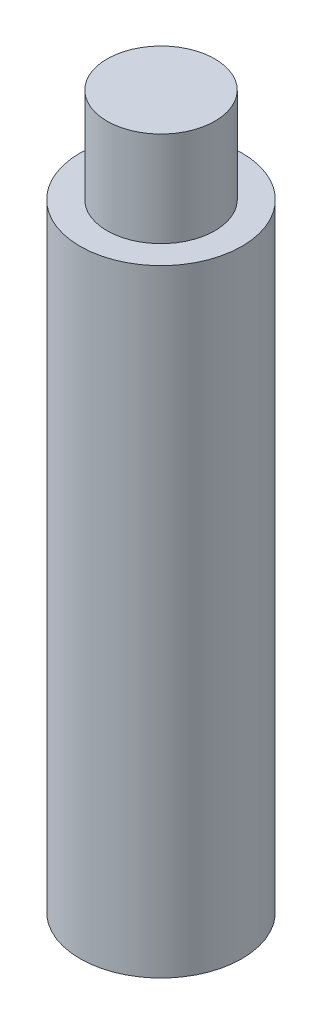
ISO-10303-21;
HEADER;
FILE_DESCRIPTION(('STEP AP214'),'2;1');
FILE_NAME('part.step','',(''),(''),'','','');
FILE_SCHEMA(('AUTOMOTIVE_DESIGN { 1 0 10303 214 1 1 1 1 }'));
ENDSEC;
DATA;
#1=APPLICATION_CONTEXT('core data for automotive mechanical design processes');
#2=APPLICATION_PROTOCOL_DEFINITION('international standard','automotive_design',2000,#1);
#3=PRODUCT_CONTEXT('',#1,'mechanical');
#4=PRODUCT('Part','Part','',(#3));
#5=PRODUCT_RELATED_PRODUCT_CATEGORY('part','',(#4));
#6=PRODUCT_DEFINITION_FORMATION('','',#4);
#7=PRODUCT_DEFINITION_CONTEXT('part definition',#1,'design');
#8=PRODUCT_DEFINITION('design','',#6,#7);
#9=PRODUCT_DEFINITION_SHAPE('','',#8);
#10=(LENGTH_UNIT() NAMED_UNIT(*) SI_UNIT(.MILLI.,.METRE.));
#11=(NAMED_UNIT(*) PLANE_ANGLE_UNIT() SI_UNIT($,.RADIAN.));
#12=(NAMED_UNIT(*) SI_UNIT($,.STERADIAN.) SOLID_ANGLE_UNIT());
#13=UNCERTAINTY_MEASURE_WITH_UNIT(LENGTH_MEASURE(1.E-05),#10,'distance_accuracy_value','');
#14=(GEOMETRIC_REPRESENTATION_CONTEXT(3) GLOBAL_UNCERTAINTY_ASSIGNED_CONTEXT((#13)) GLOBAL_UNIT_ASSIGNED_CONTEXT((#10,
#11,#12)) REPRESENTATION_CONTEXT('',''));
#15=CARTESIAN_POINT('',(0.,0.,0.));
#16=DIRECTION('',(0.,0.,1.));
#17=DIRECTION('',(1.,0.,0.));
#18=AXIS2_PLACEMENT_3D('',#15,#16,#17);
#19=CARTESIAN_POINT('',(0.,72.644,0.));
#20=DIRECTION('',(0.,1.,0.));
#21=DIRECTION('',(0.,0.,1.));
#22=AXIS2_PLACEMENT_3D('',#19,#20,#21);
#23=PLANE('',#22);
#24=CARTESIAN_POINT('',(0.,72.644,0.));
#25=DIRECTION('',(0.,1.,0.));
#26=DIRECTION('',(0.,0.,1.));
#27=AXIS2_PLACEMENT_3D('',#24,#25,#26);
#28=CIRCLE('',#27,9.525);
#29=CARTESIAN_POINT('',(0.,72.644,9.525));
#30=VERTEX_POINT('',#29);
#31=EDGE_CURVE('E10',#30,#30,#28,.T.);
#32=ORIENTED_EDGE('',*,*,#31,.T.);
#33=EDGE_LOOP('',(#32));
#34=FACE_BOUND('',#33,.T.);
#35=CARTESIAN_POINT('',(0.,72.644,0.));
#36=DIRECTION('',(0.,1.,0.));
#37=DIRECTION('',(0.,0.,1.));
#38=AXIS2_PLACEMENT_3D('',#35,#36,#37);
#39=CIRCLE('',#38,6.34999999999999);
#40=CARTESIAN_POINT('',(0.,72.644,6.34999999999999));
#41=VERTEX_POINT('',#40);
#42=EDGE_CURVE('E51',#41,#41,#39,.T.);
#43=ORIENTED_EDGE('',*,*,#42,.F.);
#44=EDGE_LOOP('',(#43));
#45=FACE_BOUND('',#44,.T.);
#46=ADVANCED_FACE('F28',(#34,#45),#23,.T.);
#47=CARTESIAN_POINT('',(0.,72.644,0.));
#48=DIRECTION('',(0.,-1.,0.));
#49=DIRECTION('',(0.,0.,-1.));
#50=AXIS2_PLACEMENT_3D('',#47,#48,#49);
#51=CYLINDRICAL_SURFACE('',#50,9.525);
#52=ORIENTED_EDGE('',*,*,#31,.F.);
#53=EDGE_LOOP('',(#52));
#54=FACE_BOUND('',#53,.T.);
#55=CARTESIAN_POINT('',(0.,0.,0.));
#56=DIRECTION('',(0.,1.,0.));
#57=DIRECTION('',(0.,0.,1.));
#58=AXIS2_PLACEMENT_3D('',#55,#56,#57);
#59=CIRCLE('',#58,9.525);
#60=CARTESIAN_POINT('',(0.,0.,9.525));
#61=VERTEX_POINT('',#60);
#62=EDGE_CURVE('E35',#61,#61,#59,.T.);
#63=ORIENTED_EDGE('',*,*,#62,.T.);
#64=EDGE_LOOP('',(#63));
#65=FACE_BOUND('',#64,.T.);
#66=ADVANCED_FACE('F30',(#54,#65),#51,.T.);
#67=CARTESIAN_POINT('',(0.,0.,0.));
#68=DIRECTION('',(0.,1.,0.));
#69=DIRECTION('',(0.,0.,1.));
#70=AXIS2_PLACEMENT_3D('',#67,#68,#69);
#71=PLANE('',#70);
#72=CARTESIAN_POINT('',(0.,0.,0.));
#73=DIRECTION('',(0.,-1.,0.));
#74=DIRECTION('',(0.,0.,-1.));
#75=AXIS2_PLACEMENT_3D('',#72,#73,#74);
#76=CIRCLE('',#75,2.9845);
#77=CARTESIAN_POINT('',(0.,0.,-2.9845));
#78=VERTEX_POINT('',#77);
#79=EDGE_CURVE('E43',#78,#78,#76,.T.);
#80=ORIENTED_EDGE('',*,*,#79,.F.);
#81=EDGE_LOOP('',(#80));
#82=FACE_BOUND('',#81,.T.);
#83=ORIENTED_EDGE('',*,*,#62,.F.);
#84=EDGE_LOOP('',(#83));
#85=FACE_BOUND('',#84,.T.);
#86=ADVANCED_FACE('F61',(#82,#85),#71,.F.);
#87=CARTESIAN_POINT('',(0.,50.8,0.));
#88=DIRECTION('',(0.,-1.,0.));
#89=DIRECTION('',(0.,0.,-1.));
#90=AXIS2_PLACEMENT_3D('',#87,#88,#89);
#91=CYLINDRICAL_SURFACE('',#90,2.9845);
#92=CARTESIAN_POINT('',(0.,50.8,0.));
#93=DIRECTION('',(0.,-1.,0.));
#94=DIRECTION('',(0.,0.,-1.));
#95=AXIS2_PLACEMENT_3D('',#92,#93,#94);
#96=CIRCLE('',#95,2.9845);
#97=CARTESIAN_POINT('',(0.,50.8,-2.9845));
#98=VERTEX_POINT('',#97);
#99=EDGE_CURVE('E39',#98,#98,#96,.T.);
#100=ORIENTED_EDGE('',*,*,#99,.F.);
#101=EDGE_LOOP('',(#100));
#102=FACE_BOUND('',#101,.T.);
#103=ORIENTED_EDGE('',*,*,#79,.T.);
#104=EDGE_LOOP('',(#103));
#105=FACE_BOUND('',#104,.T.);
#106=ADVANCED_FACE('F66',(#102,#105),#91,.F.);
#107=CARTESIAN_POINT('',(0.,50.8,0.));
#108=DIRECTION('',(0.,-1.,0.));
#109=DIRECTION('',(0.,0.,-1.));
#110=AXIS2_PLACEMENT_3D('',#107,#108,#109);
#111=PLANE('',#110);
#112=ORIENTED_EDGE('',*,*,#99,.T.);
#113=EDGE_LOOP('',(#112));
#114=FACE_BOUND('',#113,.T.);
#115=ADVANCED_FACE('F70',(#114),#111,.T.);
#116=CARTESIAN_POINT('',(0.,83.82,0.));
#117=DIRECTION('',(0.,-1.,0.));
#118=DIRECTION('',(0.,0.,-1.));
#119=AXIS2_PLACEMENT_3D('',#116,#117,#118);
#120=CYLINDRICAL_SURFACE('',#119,6.34999999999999);
#121=CARTESIAN_POINT('',(0.,83.82,0.));
#122=DIRECTION('',(0.,1.,0.));
#123=DIRECTION('',(0.,0.,1.));
#124=AXIS2_PLACEMENT_3D('',#121,#122,#123);
#125=CIRCLE('',#124,6.34999999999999);
#126=CARTESIAN_POINT('',(0.,83.82,6.34999999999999));
#127=VERTEX_POINT('',#126);
#128=EDGE_CURVE('E48',#127,#127,#125,.T.);
#129=ORIENTED_EDGE('',*,*,#128,.F.);
#130=EDGE_LOOP('',(#129));
#131=FACE_BOUND('',#130,.T.);
#132=ORIENTED_EDGE('',*,*,#42,.T.);
#133=EDGE_LOOP('',(#132));
#134=FACE_BOUND('',#133,.T.);
#135=ADVANCED_FACE('F55',(#131,#134),#120,.T.);
#136=CARTESIAN_POINT('',(0.,83.82,0.));
#137=DIRECTION('',(0.,1.,0.));
#138=DIRECTION('',(0.,0.,1.));
#139=AXIS2_PLACEMENT_3D('',#136,#137,#138);
#140=PLANE('',#139);
#141=ORIENTED_EDGE('',*,*,#128,.T.);
#142=EDGE_LOOP('',(#141));
#143=FACE_BOUND('',#142,.T.);
#144=ADVANCED_FACE('F77',(#143),#140,.T.);
#145=CLOSED_SHELL('',(#46,#66,#86,#106,#115,#135,#144));
#146=MANIFOLD_SOLID_BREP('B2',#145);
#147=ADVANCED_BREP_SHAPE_REPRESENTATION('',(#18,#146),#14);
#148=SHAPE_DEFINITION_REPRESENTATION(#9,#147);
ENDSEC;
END-ISO-10303-21;
